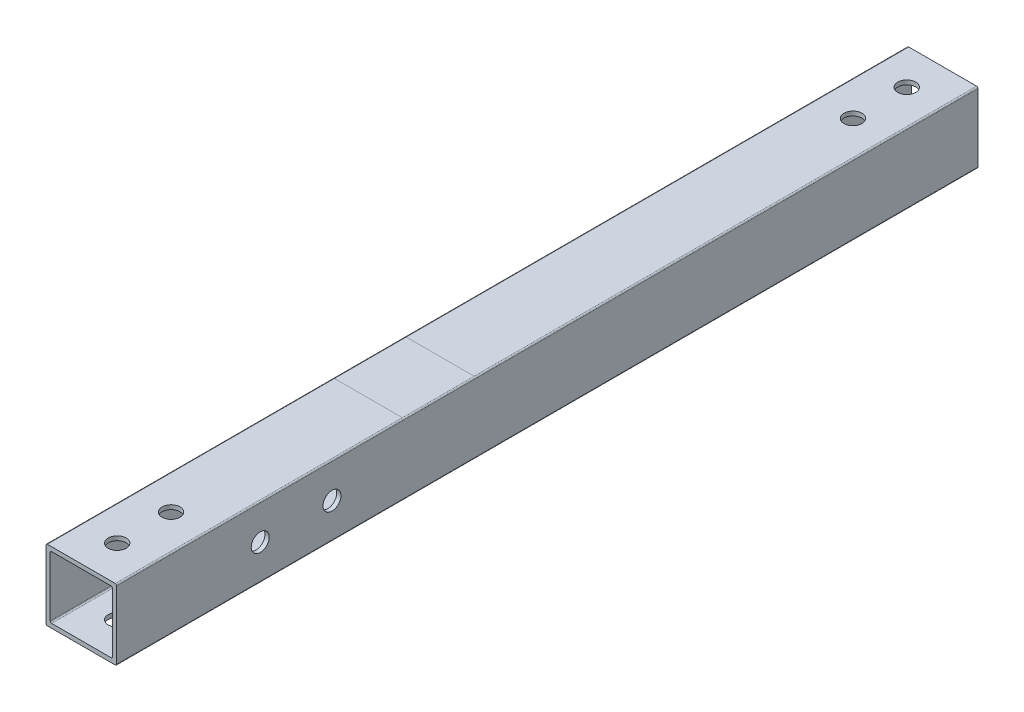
ISO-10303-21;
HEADER;
FILE_DESCRIPTION(('STEP AP214'),'2;1');
FILE_NAME('part.step','',(''),(''),'','','');
FILE_SCHEMA(('AUTOMOTIVE_DESIGN { 1 0 10303 214 1 1 1 1 }'));
ENDSEC;
DATA;
#1=APPLICATION_CONTEXT('core data for automotive mechanical design processes');
#2=APPLICATION_PROTOCOL_DEFINITION('international standard','automotive_design',2000,#1);
#3=PRODUCT_CONTEXT('',#1,'mechanical');
#4=PRODUCT('Part','Part','',(#3));
#5=PRODUCT_RELATED_PRODUCT_CATEGORY('part','',(#4));
#6=PRODUCT_DEFINITION_FORMATION('','',#4);
#7=PRODUCT_DEFINITION_CONTEXT('part definition',#1,'design');
#8=PRODUCT_DEFINITION('design','',#6,#7);
#9=PRODUCT_DEFINITION_SHAPE('','',#8);
#10=(LENGTH_UNIT() NAMED_UNIT(*) SI_UNIT(.MILLI.,.METRE.));
#11=(NAMED_UNIT(*) PLANE_ANGLE_UNIT() SI_UNIT($,.RADIAN.));
#12=(NAMED_UNIT(*) SI_UNIT($,.STERADIAN.) SOLID_ANGLE_UNIT());
#13=UNCERTAINTY_MEASURE_WITH_UNIT(LENGTH_MEASURE(1.E-05),#10,'distance_accuracy_value','');
#14=(GEOMETRIC_REPRESENTATION_CONTEXT(3) GLOBAL_UNCERTAINTY_ASSIGNED_CONTEXT((#13)) GLOBAL_UNIT_ASSIGNED_CONTEXT((#10,
#11,#12)) REPRESENTATION_CONTEXT('',''));
#15=CARTESIAN_POINT('',(0.,0.,0.));
#16=DIRECTION('',(0.,0.,1.));
#17=DIRECTION('',(1.,0.,0.));
#18=AXIS2_PLACEMENT_3D('',#15,#16,#17);
#19=CARTESIAN_POINT('',(-11.9999999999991,12.5,-1695.2));
#20=DIRECTION('',(0.,1.,0.));
#21=DIRECTION('',(-1.,0.,0.));
#22=AXIS2_PLACEMENT_3D('',#19,#20,#21);
#23=PLANE('',#22);
#24=CARTESIAN_POINT('',(0.,12.5,-1726.95));
#25=DIRECTION('',(0.,1.,0.));
#26=DIRECTION('',(1.,0.,0.));
#27=AXIS2_PLACEMENT_3D('',#24,#25,#26);
#28=CIRCLE('',#27,3.17500000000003);
#29=CARTESIAN_POINT('',(3.17500000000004,12.5,-1726.95));
#30=VERTEX_POINT('',#29);
#31=EDGE_CURVE('E366',#30,#30,#28,.T.);
#32=ORIENTED_EDGE('',*,*,#31,.F.);
#33=EDGE_LOOP('',(#32));
#34=FACE_BOUND('',#33,.T.);
#35=CARTESIAN_POINT('',(0.,12.5,-1707.9));
#36=DIRECTION('',(0.,1.,0.));
#37=DIRECTION('',(1.,0.,0.));
#38=AXIS2_PLACEMENT_3D('',#35,#36,#37);
#39=CIRCLE('',#38,3.17500000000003);
#40=CARTESIAN_POINT('',(3.17500000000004,12.5,-1707.9));
#41=VERTEX_POINT('',#40);
#42=EDGE_CURVE('E373',#41,#41,#39,.T.);
#43=ORIENTED_EDGE('',*,*,#42,.F.);
#44=EDGE_LOOP('',(#43));
#45=FACE_BOUND('',#44,.T.);
#46=DIRECTION('',(0.,0.,-1.));
#47=VECTOR('',#46,1.);
#48=CARTESIAN_POINT('',(11.9999999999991,12.5,-1695.2));
#49=LINE('',#48,#47);
#50=CARTESIAN_POINT('',(11.9999999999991,12.5,-1695.2));
#51=VERTEX_POINT('',#50);
#52=CARTESIAN_POINT('',(11.9999999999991,12.5,-1796.8));
#53=VERTEX_POINT('',#52);
#54=EDGE_CURVE('E303',#51,#53,#49,.T.);
#55=ORIENTED_EDGE('',*,*,#54,.T.);
#56=DIRECTION('',(-1.,0.,0.));
#57=VECTOR('',#56,1.);
#58=CARTESIAN_POINT('',(-11.9999999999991,12.5,-1796.8));
#59=LINE('',#58,#57);
#60=CARTESIAN_POINT('',(-11.9999999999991,12.5,-1796.8));
#61=VERTEX_POINT('',#60);
#62=EDGE_CURVE('E11',#53,#61,#59,.T.);
#63=ORIENTED_EDGE('',*,*,#62,.T.);
#64=DIRECTION('',(0.,0.,-1.));
#65=VECTOR('',#64,1.);
#66=CARTESIAN_POINT('',(-11.9999999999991,12.5,-1695.2));
#67=LINE('',#66,#65);
#68=CARTESIAN_POINT('',(-11.9999999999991,12.5,-1695.2));
#69=VERTEX_POINT('',#68);
#70=EDGE_CURVE('E308',#69,#61,#67,.T.);
#71=ORIENTED_EDGE('',*,*,#70,.F.);
#72=DIRECTION('',(1.,0.,0.));
#73=VECTOR('',#72,1.);
#74=CARTESIAN_POINT('',(-11.9999999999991,12.5,-1695.2));
#75=LINE('',#74,#73);
#76=EDGE_CURVE('E257',#69,#51,#75,.T.);
#77=ORIENTED_EDGE('',*,*,#76,.T.);
#78=EDGE_LOOP('',(#55,#63,#71,#77));
#79=FACE_BOUND('',#78,.T.);
#80=ADVANCED_FACE('F44',(#34,#45,#79),#23,.T.);
#81=CARTESIAN_POINT('',(0.,12.5,-1968.25));
#82=DIRECTION('',(0.,1.,0.));
#83=DIRECTION('',(-1.,0.,0.));
#84=AXIS2_PLACEMENT_3D('',#81,#82,#83);
#85=CIRCLE('',#84,3.17500000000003);
#86=CARTESIAN_POINT('',(-3.17500000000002,12.5,-1968.25));
#87=VERTEX_POINT('',#86);
#88=EDGE_CURVE('E361',#87,#87,#85,.T.);
#89=ORIENTED_EDGE('',*,*,#88,.F.);
#90=EDGE_LOOP('',(#89));
#91=FACE_BOUND('',#90,.T.);
#92=CARTESIAN_POINT('',(0.,12.5,-1987.3));
#93=DIRECTION('',(0.,1.,0.));
#94=DIRECTION('',(-1.,0.,0.));
#95=AXIS2_PLACEMENT_3D('',#92,#93,#94);
#96=CIRCLE('',#95,3.17500000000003);
#97=CARTESIAN_POINT('',(-3.17500000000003,12.5,-1987.3));
#98=VERTEX_POINT('',#97);
#99=EDGE_CURVE('E358',#98,#98,#96,.T.);
#100=ORIENTED_EDGE('',*,*,#99,.F.);
#101=EDGE_LOOP('',(#100));
#102=FACE_BOUND('',#101,.T.);
#103=CARTESIAN_POINT('',(-11.9999999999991,12.5,-1822.2));
#104=VERTEX_POINT('',#103);
#105=CARTESIAN_POINT('',(-11.9999999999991,12.5,-2000.));
#106=VERTEX_POINT('',#105);
#107=EDGE_CURVE('E312',#104,#106,#67,.T.);
#108=ORIENTED_EDGE('',*,*,#107,.F.);
#109=DIRECTION('',(1.,0.,0.));
#110=VECTOR('',#109,1.);
#111=CARTESIAN_POINT('',(-11.9999999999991,12.5,-1822.2));
#112=LINE('',#111,#110);
#113=CARTESIAN_POINT('',(11.9999999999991,12.5,-1822.2));
#114=VERTEX_POINT('',#113);
#115=EDGE_CURVE('E53',#104,#114,#112,.T.);
#116=ORIENTED_EDGE('',*,*,#115,.T.);
#117=CARTESIAN_POINT('',(11.9999999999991,12.5,-2000.));
#118=VERTEX_POINT('',#117);
#119=EDGE_CURVE('E307',#114,#118,#49,.T.);
#120=ORIENTED_EDGE('',*,*,#119,.T.);
#121=DIRECTION('',(1.,0.,0.));
#122=VECTOR('',#121,1.);
#123=CARTESIAN_POINT('',(-11.9999999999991,12.5,-2000.));
#124=LINE('',#123,#122);
#125=EDGE_CURVE('E281',#106,#118,#124,.T.);
#126=ORIENTED_EDGE('',*,*,#125,.F.);
#127=EDGE_LOOP('',(#108,#116,#120,#126));
#128=FACE_BOUND('',#127,.T.);
#129=ADVANCED_FACE('F413',(#91,#102,#128),#23,.T.);
#130=CARTESIAN_POINT('',(-11.9999999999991,-11.9999999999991,-1695.2));
#131=DIRECTION('',(0.,0.,-1.));
#132=DIRECTION('',(-1.,0.,0.));
#133=AXIS2_PLACEMENT_3D('',#130,#131,#132);
#134=CYLINDRICAL_SURFACE('',#133,0.500000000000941);
#135=CARTESIAN_POINT('',(-11.9999999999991,-11.9999999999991,-2000.));
#136=DIRECTION('',(0.,0.,-1.));
#137=DIRECTION('',(-1.,0.,0.));
#138=AXIS2_PLACEMENT_3D('',#135,#136,#137);
#139=CIRCLE('',#138,0.500000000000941);
#140=CARTESIAN_POINT('',(-11.9999999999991,-12.5,-2000.));
#141=VERTEX_POINT('',#140);
#142=CARTESIAN_POINT('',(-12.5,-11.9999999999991,-2000.));
#143=VERTEX_POINT('',#142);
#144=EDGE_CURVE('E235',#141,#143,#139,.T.);
#145=ORIENTED_EDGE('',*,*,#144,.F.);
#146=DIRECTION('',(0.,0.,-1.));
#147=VECTOR('',#146,1.);
#148=CARTESIAN_POINT('',(-11.9999999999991,-12.5,-1695.2));
#149=LINE('',#148,#147);
#150=CARTESIAN_POINT('',(-11.9999999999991,-12.5,-1695.2));
#151=VERTEX_POINT('',#150);
#152=EDGE_CURVE('E295',#151,#141,#149,.T.);
#153=ORIENTED_EDGE('',*,*,#152,.F.);
#154=CARTESIAN_POINT('',(-11.9999999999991,-11.9999999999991,-1695.2));
#155=DIRECTION('',(0.,0.,-1.));
#156=DIRECTION('',(-1.,0.,0.));
#157=AXIS2_PLACEMENT_3D('',#154,#155,#156);
#158=CIRCLE('',#157,0.500000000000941);
#159=CARTESIAN_POINT('',(-12.5,-11.9999999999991,-1695.2));
#160=VERTEX_POINT('',#159);
#161=EDGE_CURVE('E247',#151,#160,#158,.T.);
#162=ORIENTED_EDGE('',*,*,#161,.T.);
#163=DIRECTION('',(0.,0.,-1.));
#164=VECTOR('',#163,1.);
#165=CARTESIAN_POINT('',(-12.5,-11.9999999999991,-1695.2));
#166=LINE('',#165,#164);
#167=EDGE_CURVE('E272',#160,#143,#166,.T.);
#168=ORIENTED_EDGE('',*,*,#167,.T.);
#169=EDGE_LOOP('',(#145,#153,#162,#168));
#170=FACE_BOUND('',#169,.T.);
#171=ADVANCED_FACE('F46',(#170),#134,.T.);
#172=CARTESIAN_POINT('',(11.9999999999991,-12.5,-1695.2));
#173=DIRECTION('',(0.,-1.,0.));
#174=DIRECTION('',(1.,0.,0.));
#175=AXIS2_PLACEMENT_3D('',#172,#173,#174);
#176=PLANE('',#175);
#177=CARTESIAN_POINT('',(0.,-12.5,-1987.3));
#178=DIRECTION('',(0.,-1.,0.));
#179=DIRECTION('',(1.,0.,0.));
#180=AXIS2_PLACEMENT_3D('',#177,#178,#179);
#181=CIRCLE('',#180,3.17500000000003);
#182=CARTESIAN_POINT('',(3.17500000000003,-12.5,-1987.3));
#183=VERTEX_POINT('',#182);
#184=EDGE_CURVE('E320',#183,#183,#181,.F.);
#185=ORIENTED_EDGE('',*,*,#184,.T.);
#186=EDGE_LOOP('',(#185));
#187=FACE_BOUND('',#186,.T.);
#188=CARTESIAN_POINT('',(0.,-12.5,-1726.95));
#189=DIRECTION('',(0.,-1.,0.));
#190=DIRECTION('',(1.,0.,0.));
#191=AXIS2_PLACEMENT_3D('',#188,#189,#190);
#192=CIRCLE('',#191,3.17500000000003);
#193=CARTESIAN_POINT('',(3.17500000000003,-12.5,-1726.95));
#194=VERTEX_POINT('',#193);
#195=EDGE_CURVE('E348',#194,#194,#192,.F.);
#196=ORIENTED_EDGE('',*,*,#195,.T.);
#197=EDGE_LOOP('',(#196));
#198=FACE_BOUND('',#197,.T.);
#199=CARTESIAN_POINT('',(0.,-12.5,-1707.9));
#200=DIRECTION('',(0.,-1.,0.));
#201=DIRECTION('',(1.,0.,0.));
#202=AXIS2_PLACEMENT_3D('',#199,#200,#201);
#203=CIRCLE('',#202,3.17500000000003);
#204=CARTESIAN_POINT('',(3.17500000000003,-12.5,-1707.9));
#205=VERTEX_POINT('',#204);
#206=EDGE_CURVE('E369',#205,#205,#203,.F.);
#207=ORIENTED_EDGE('',*,*,#206,.T.);
#208=EDGE_LOOP('',(#207));
#209=FACE_BOUND('',#208,.T.);
#210=CARTESIAN_POINT('',(0.,-12.5,-1968.25));
#211=DIRECTION('',(0.,-1.,0.));
#212=DIRECTION('',(1.,0.,0.));
#213=AXIS2_PLACEMENT_3D('',#210,#211,#212);
#214=CIRCLE('',#213,3.17500000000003);
#215=CARTESIAN_POINT('',(3.17500000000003,-12.5,-1968.25));
#216=VERTEX_POINT('',#215);
#217=EDGE_CURVE('E370',#216,#216,#214,.F.);
#218=ORIENTED_EDGE('',*,*,#217,.T.);
#219=EDGE_LOOP('',(#218));
#220=FACE_BOUND('',#219,.T.);
#221=DIRECTION('',(-1.,0.,0.));
#222=VECTOR('',#221,1.);
#223=CARTESIAN_POINT('',(11.9999999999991,-12.5,-2000.));
#224=LINE('',#223,#222);
#225=CARTESIAN_POINT('',(11.9999999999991,-12.5,-2000.));
#226=VERTEX_POINT('',#225);
#227=EDGE_CURVE('E251',#226,#141,#224,.T.);
#228=ORIENTED_EDGE('',*,*,#227,.F.);
#229=DIRECTION('',(0.,0.,-1.));
#230=VECTOR('',#229,1.);
#231=CARTESIAN_POINT('',(11.9999999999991,-12.5,-1695.2));
#232=LINE('',#231,#230);
#233=CARTESIAN_POINT('',(11.9999999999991,-12.5,-1695.2));
#234=VERTEX_POINT('',#233);
#235=EDGE_CURVE('E297',#234,#226,#232,.T.);
#236=ORIENTED_EDGE('',*,*,#235,.F.);
#237=DIRECTION('',(-1.,0.,0.));
#238=VECTOR('',#237,1.);
#239=CARTESIAN_POINT('',(11.9999999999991,-12.5,-1695.2));
#240=LINE('',#239,#238);
#241=EDGE_CURVE('E269',#234,#151,#240,.T.);
#242=ORIENTED_EDGE('',*,*,#241,.T.);
#243=ORIENTED_EDGE('',*,*,#152,.T.);
#244=EDGE_LOOP('',(#228,#236,#242,#243));
#245=FACE_BOUND('',#244,.T.);
#246=ADVANCED_FACE('F447',(#187,#198,#209,#220,#245),#176,.T.);
#247=CARTESIAN_POINT('',(11.9999999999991,-11.9999999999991,-1695.2));
#248=DIRECTION('',(0.,0.,-1.));
#249=DIRECTION('',(-1.,0.,0.));
#250=AXIS2_PLACEMENT_3D('',#247,#248,#249);
#251=CYLINDRICAL_SURFACE('',#250,0.500000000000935);
#252=CARTESIAN_POINT('',(11.9999999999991,-11.9999999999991,-2000.));
#253=DIRECTION('',(0.,0.,-1.));
#254=DIRECTION('',(-1.,0.,0.));
#255=AXIS2_PLACEMENT_3D('',#252,#253,#254);
#256=CIRCLE('',#255,0.500000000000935);
#257=CARTESIAN_POINT('',(12.5,-11.9999999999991,-2000.));
#258=VERTEX_POINT('',#257);
#259=EDGE_CURVE('E290',#258,#226,#256,.T.);
#260=ORIENTED_EDGE('',*,*,#259,.F.);
#261=DIRECTION('',(0.,0.,-1.));
#262=VECTOR('',#261,1.);
#263=CARTESIAN_POINT('',(12.5,-11.9999999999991,-1695.2));
#264=LINE('',#263,#262);
#265=CARTESIAN_POINT('',(12.5,-11.9999999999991,-1695.2));
#266=VERTEX_POINT('',#265);
#267=EDGE_CURVE('E299',#266,#258,#264,.T.);
#268=ORIENTED_EDGE('',*,*,#267,.F.);
#269=CARTESIAN_POINT('',(11.9999999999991,-11.9999999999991,-1695.2));
#270=DIRECTION('',(0.,0.,-1.));
#271=DIRECTION('',(-1.,0.,0.));
#272=AXIS2_PLACEMENT_3D('',#269,#270,#271);
#273=CIRCLE('',#272,0.500000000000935);
#274=EDGE_CURVE('E266',#266,#234,#273,.T.);
#275=ORIENTED_EDGE('',*,*,#274,.T.);
#276=ORIENTED_EDGE('',*,*,#235,.T.);
#277=EDGE_LOOP('',(#260,#268,#275,#276));
#278=FACE_BOUND('',#277,.T.);
#279=ADVANCED_FACE('F440',(#278),#251,.T.);
#280=CARTESIAN_POINT('',(12.5,11.9999999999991,-1695.2));
#281=DIRECTION('',(1.,0.,0.));
#282=DIRECTION('',(0.,1.,0.));
#283=AXIS2_PLACEMENT_3D('',#280,#281,#282);
#284=PLANE('',#283);
#285=CARTESIAN_POINT('',(12.5,0.,-1771.4));
#286=DIRECTION('',(1.,0.,0.));
#287=DIRECTION('',(0.,1.,0.));
#288=AXIS2_PLACEMENT_3D('',#285,#286,#287);
#289=CIRCLE('',#288,3.17499999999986);
#290=CARTESIAN_POINT('',(12.5,3.17499999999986,-1771.4));
#291=VERTEX_POINT('',#290);
#292=EDGE_CURVE('E790',#291,#291,#289,.T.);
#293=ORIENTED_EDGE('',*,*,#292,.F.);
#294=EDGE_LOOP('',(#293));
#295=FACE_BOUND('',#294,.T.);
#296=CARTESIAN_POINT('',(12.5,0.,-1746.));
#297=DIRECTION('',(1.,0.,0.));
#298=DIRECTION('',(0.,1.,0.));
#299=AXIS2_PLACEMENT_3D('',#296,#297,#298);
#300=CIRCLE('',#299,3.17499999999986);
#301=CARTESIAN_POINT('',(12.5,3.17499999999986,-1746.));
#302=VERTEX_POINT('',#301);
#303=EDGE_CURVE('E355',#302,#302,#300,.T.);
#304=ORIENTED_EDGE('',*,*,#303,.F.);
#305=EDGE_LOOP('',(#304));
#306=FACE_BOUND('',#305,.T.);
#307=DIRECTION('',(0.,-1.,0.));
#308=VECTOR('',#307,1.);
#309=CARTESIAN_POINT('',(12.5,11.9999999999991,-2000.));
#310=LINE('',#309,#308);
#311=CARTESIAN_POINT('',(12.5,11.9999999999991,-2000.));
#312=VERTEX_POINT('',#311);
#313=EDGE_CURVE('E287',#312,#258,#310,.T.);
#314=ORIENTED_EDGE('',*,*,#313,.F.);
#315=DIRECTION('',(0.,0.,-1.));
#316=VECTOR('',#315,1.);
#317=CARTESIAN_POINT('',(12.5,11.9999999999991,-1695.2));
#318=LINE('',#317,#316);
#319=CARTESIAN_POINT('',(12.5,11.9999999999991,-1695.2));
#320=VERTEX_POINT('',#319);
#321=EDGE_CURVE('E301',#320,#312,#318,.T.);
#322=ORIENTED_EDGE('',*,*,#321,.F.);
#323=DIRECTION('',(0.,-1.,0.));
#324=VECTOR('',#323,1.);
#325=CARTESIAN_POINT('',(12.5,11.9999999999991,-1695.2));
#326=LINE('',#325,#324);
#327=EDGE_CURVE('E263',#320,#266,#326,.T.);
#328=ORIENTED_EDGE('',*,*,#327,.T.);
#329=ORIENTED_EDGE('',*,*,#267,.T.);
#330=EDGE_LOOP('',(#314,#322,#328,#329));
#331=FACE_BOUND('',#330,.T.);
#332=ADVANCED_FACE('F435',(#295,#306,#331),#284,.T.);
#333=CARTESIAN_POINT('',(11.9999999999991,11.9999999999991,-1695.2));
#334=DIRECTION('',(0.,0.,-1.));
#335=DIRECTION('',(-1.,0.,0.));
#336=AXIS2_PLACEMENT_3D('',#333,#334,#335);
#337=CYLINDRICAL_SURFACE('',#336,0.500000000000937);
#338=CARTESIAN_POINT('',(11.9999999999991,11.9999999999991,-2000.));
#339=DIRECTION('',(0.,0.,-1.));
#340=DIRECTION('',(-1.,0.,0.));
#341=AXIS2_PLACEMENT_3D('',#338,#339,#340);
#342=CIRCLE('',#341,0.500000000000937);
#343=EDGE_CURVE('E284',#118,#312,#342,.T.);
#344=ORIENTED_EDGE('',*,*,#343,.F.);
#345=ORIENTED_EDGE('',*,*,#119,.F.);
#346=EDGE_CURVE('E306',#53,#114,#49,.T.);
#347=ORIENTED_EDGE('',*,*,#346,.F.);
#348=ORIENTED_EDGE('',*,*,#54,.F.);
#349=CARTESIAN_POINT('',(11.9999999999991,11.9999999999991,-1695.2));
#350=DIRECTION('',(0.,0.,-1.));
#351=DIRECTION('',(-1.,0.,0.));
#352=AXIS2_PLACEMENT_3D('',#349,#350,#351);
#353=CIRCLE('',#352,0.500000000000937);
#354=EDGE_CURVE('E260',#51,#320,#353,.T.);
#355=ORIENTED_EDGE('',*,*,#354,.T.);
#356=ORIENTED_EDGE('',*,*,#321,.T.);
#357=EDGE_LOOP('',(#344,#345,#347,#348,#355,#356));
#358=FACE_BOUND('',#357,.T.);
#359=ADVANCED_FACE('F428',(#358),#337,.T.);
#360=ORIENTED_EDGE('',*,*,#62,.F.);
#361=ORIENTED_EDGE('',*,*,#346,.T.);
#362=ORIENTED_EDGE('',*,*,#115,.F.);
#363=EDGE_CURVE('E311',#61,#104,#67,.T.);
#364=ORIENTED_EDGE('',*,*,#363,.F.);
#365=EDGE_LOOP('',(#360,#361,#362,#364));
#366=FACE_BOUND('',#365,.T.);
#367=ADVANCED_FACE('F416',(#366),#23,.T.);
#368=CARTESIAN_POINT('',(-11.9999999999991,11.9999999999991,-1695.2));
#369=DIRECTION('',(0.,0.,-1.));
#370=DIRECTION('',(-1.,0.,0.));
#371=AXIS2_PLACEMENT_3D('',#368,#369,#370);
#372=CYLINDRICAL_SURFACE('',#371,0.500000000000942);
#373=CARTESIAN_POINT('',(-11.9999999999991,11.9999999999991,-2000.));
#374=DIRECTION('',(0.,0.,-1.));
#375=DIRECTION('',(-1.,0.,0.));
#376=AXIS2_PLACEMENT_3D('',#373,#374,#375);
#377=CIRCLE('',#376,0.500000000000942);
#378=CARTESIAN_POINT('',(-12.5,11.9999999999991,-2000.));
#379=VERTEX_POINT('',#378);
#380=EDGE_CURVE('E278',#379,#106,#377,.T.);
#381=ORIENTED_EDGE('',*,*,#380,.F.);
#382=DIRECTION('',(0.,0.,-1.));
#383=VECTOR('',#382,1.);
#384=CARTESIAN_POINT('',(-12.5,11.9999999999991,-1695.2));
#385=LINE('',#384,#383);
#386=CARTESIAN_POINT('',(-12.5,11.9999999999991,-1695.2));
#387=VERTEX_POINT('',#386);
#388=EDGE_CURVE('E313',#387,#379,#385,.T.);
#389=ORIENTED_EDGE('',*,*,#388,.F.);
#390=CARTESIAN_POINT('',(-11.9999999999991,11.9999999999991,-1695.2));
#391=DIRECTION('',(0.,0.,-1.));
#392=DIRECTION('',(-1.,0.,0.));
#393=AXIS2_PLACEMENT_3D('',#390,#391,#392);
#394=CIRCLE('',#393,0.500000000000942);
#395=EDGE_CURVE('E254',#387,#69,#394,.T.);
#396=ORIENTED_EDGE('',*,*,#395,.T.);
#397=ORIENTED_EDGE('',*,*,#70,.T.);
#398=ORIENTED_EDGE('',*,*,#363,.T.);
#399=ORIENTED_EDGE('',*,*,#107,.T.);
#400=EDGE_LOOP('',(#381,#389,#396,#397,#398,#399));
#401=FACE_BOUND('',#400,.T.);
#402=ADVANCED_FACE('F427',(#401),#372,.T.);
#403=CARTESIAN_POINT('',(-12.5,-11.9999999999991,-1695.2));
#404=DIRECTION('',(-1.,0.,0.));
#405=DIRECTION('',(0.,0.,1.));
#406=AXIS2_PLACEMENT_3D('',#403,#404,#405);
#407=PLANE('',#406);
#408=CARTESIAN_POINT('',(-12.5,0.,-1771.4));
#409=DIRECTION('',(-1.,0.,0.));
#410=DIRECTION('',(0.,0.,1.));
#411=AXIS2_PLACEMENT_3D('',#408,#409,#410);
#412=CIRCLE('',#411,3.17499999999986);
#413=CARTESIAN_POINT('',(-12.5,3.17499999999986,-1771.4));
#414=VERTEX_POINT('',#413);
#415=EDGE_CURVE('E336',#414,#414,#412,.F.);
#416=ORIENTED_EDGE('',*,*,#415,.T.);
#417=EDGE_LOOP('',(#416));
#418=FACE_BOUND('',#417,.T.);
#419=CARTESIAN_POINT('',(-12.5,0.,-1746.));
#420=DIRECTION('',(-1.,0.,0.));
#421=DIRECTION('',(0.,0.,1.));
#422=AXIS2_PLACEMENT_3D('',#419,#420,#421);
#423=CIRCLE('',#422,3.17499999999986);
#424=CARTESIAN_POINT('',(-12.5,3.17499999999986,-1746.));
#425=VERTEX_POINT('',#424);
#426=EDGE_CURVE('E794',#425,#425,#423,.F.);
#427=ORIENTED_EDGE('',*,*,#426,.T.);
#428=EDGE_LOOP('',(#427));
#429=FACE_BOUND('',#428,.T.);
#430=DIRECTION('',(0.,1.,0.));
#431=VECTOR('',#430,1.);
#432=CARTESIAN_POINT('',(-12.5,-11.9999999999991,-2000.));
#433=LINE('',#432,#431);
#434=EDGE_CURVE('E275',#143,#379,#433,.T.);
#435=ORIENTED_EDGE('',*,*,#434,.F.);
#436=ORIENTED_EDGE('',*,*,#167,.F.);
#437=DIRECTION('',(0.,1.,0.));
#438=VECTOR('',#437,1.);
#439=CARTESIAN_POINT('',(-12.5,-11.9999999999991,-1695.2));
#440=LINE('',#439,#438);
#441=EDGE_CURVE('E250',#160,#387,#440,.T.);
#442=ORIENTED_EDGE('',*,*,#441,.T.);
#443=ORIENTED_EDGE('',*,*,#388,.T.);
#444=EDGE_LOOP('',(#435,#436,#442,#443));
#445=FACE_BOUND('',#444,.T.);
#446=ADVANCED_FACE('F433',(#418,#429,#445),#407,.T.);
#447=CARTESIAN_POINT('',(-11.9999999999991,-11.9999999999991,-1695.2));
#448=DIRECTION('',(0.,0.,-1.));
#449=DIRECTION('',(-1.,0.,0.));
#450=AXIS2_PLACEMENT_3D('',#447,#448,#449);
#451=PLANE('',#450);
#452=DIRECTION('',(0.,1.,0.));
#453=VECTOR('',#452,1.);
#454=CARTESIAN_POINT('',(-11.,10.4999999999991,-1695.2));
#455=LINE('',#454,#453);
#456=CARTESIAN_POINT('',(-11.,-10.4999999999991,-1695.2));
#457=VERTEX_POINT('',#456);
#458=CARTESIAN_POINT('',(-11.,10.4999999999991,-1695.2));
#459=VERTEX_POINT('',#458);
#460=EDGE_CURVE('E180',#457,#459,#455,.T.);
#461=ORIENTED_EDGE('',*,*,#460,.T.);
#462=CARTESIAN_POINT('',(-10.4999999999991,10.4999999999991,-1695.2));
#463=DIRECTION('',(0.,0.,-1.));
#464=DIRECTION('',(1.,0.,0.));
#465=AXIS2_PLACEMENT_3D('',#462,#463,#464);
#466=CIRCLE('',#465,0.500000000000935);
#467=CARTESIAN_POINT('',(-10.4999999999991,11.,-1695.2));
#468=VERTEX_POINT('',#467);
#469=EDGE_CURVE('E172',#459,#468,#466,.T.);
#470=ORIENTED_EDGE('',*,*,#469,.T.);
#471=DIRECTION('',(1.,0.,0.));
#472=VECTOR('',#471,1.);
#473=CARTESIAN_POINT('',(10.4999999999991,11.,-1695.2));
#474=LINE('',#473,#472);
#475=CARTESIAN_POINT('',(10.4999999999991,11.,-1695.2));
#476=VERTEX_POINT('',#475);
#477=EDGE_CURVE('E184',#468,#476,#474,.T.);
#478=ORIENTED_EDGE('',*,*,#477,.T.);
#479=CARTESIAN_POINT('',(10.4999999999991,10.4999999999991,-1695.2));
#480=DIRECTION('',(0.,0.,-1.));
#481=DIRECTION('',(1.,0.,0.));
#482=AXIS2_PLACEMENT_3D('',#479,#480,#481);
#483=CIRCLE('',#482,0.500000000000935);
#484=CARTESIAN_POINT('',(11.,10.4999999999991,-1695.2));
#485=VERTEX_POINT('',#484);
#486=EDGE_CURVE('E188',#476,#485,#483,.T.);
#487=ORIENTED_EDGE('',*,*,#486,.T.);
#488=DIRECTION('',(0.,-1.,0.));
#489=VECTOR('',#488,1.);
#490=CARTESIAN_POINT('',(11.,-10.4999999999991,-1695.2));
#491=LINE('',#490,#489);
#492=CARTESIAN_POINT('',(11.,-10.4999999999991,-1695.2));
#493=VERTEX_POINT('',#492);
#494=EDGE_CURVE('E204',#485,#493,#491,.T.);
#495=ORIENTED_EDGE('',*,*,#494,.T.);
#496=CARTESIAN_POINT('',(10.4999999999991,-10.4999999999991,-1695.2));
#497=DIRECTION('',(0.,0.,-1.));
#498=DIRECTION('',(1.,0.,0.));
#499=AXIS2_PLACEMENT_3D('',#496,#497,#498);
#500=CIRCLE('',#499,0.500000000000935);
#501=CARTESIAN_POINT('',(10.4999999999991,-11.,-1695.2));
#502=VERTEX_POINT('',#501);
#503=EDGE_CURVE('E207',#493,#502,#500,.T.);
#504=ORIENTED_EDGE('',*,*,#503,.T.);
#505=DIRECTION('',(-1.,0.,0.));
#506=VECTOR('',#505,1.);
#507=CARTESIAN_POINT('',(-10.4999999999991,-11.,-1695.2));
#508=LINE('',#507,#506);
#509=CARTESIAN_POINT('',(-10.4999999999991,-11.,-1695.2));
#510=VERTEX_POINT('',#509);
#511=EDGE_CURVE('E210',#502,#510,#508,.T.);
#512=ORIENTED_EDGE('',*,*,#511,.T.);
#513=CARTESIAN_POINT('',(-10.4999999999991,-10.4999999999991,-1695.2));
#514=DIRECTION('',(0.,0.,-1.));
#515=DIRECTION('',(1.,0.,0.));
#516=AXIS2_PLACEMENT_3D('',#513,#514,#515);
#517=CIRCLE('',#516,0.500000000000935);
#518=EDGE_CURVE('E213',#510,#457,#517,.T.);
#519=ORIENTED_EDGE('',*,*,#518,.T.);
#520=EDGE_LOOP('',(#461,#470,#478,#487,#495,#504,#512,#519));
#521=FACE_BOUND('',#520,.T.);
#522=ORIENTED_EDGE('',*,*,#161,.F.);
#523=ORIENTED_EDGE('',*,*,#241,.F.);
#524=ORIENTED_EDGE('',*,*,#274,.F.);
#525=ORIENTED_EDGE('',*,*,#327,.F.);
#526=ORIENTED_EDGE('',*,*,#354,.F.);
#527=ORIENTED_EDGE('',*,*,#76,.F.);
#528=ORIENTED_EDGE('',*,*,#395,.F.);
#529=ORIENTED_EDGE('',*,*,#441,.F.);
#530=EDGE_LOOP('',(#522,#523,#524,#525,#526,#527,#528,#529));
#531=FACE_BOUND('',#530,.T.);
#532=ADVANCED_FACE('F190',(#521,#531),#451,.F.);
#533=CARTESIAN_POINT('',(-11.9999999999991,-11.9999999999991,-2000.));
#534=DIRECTION('',(0.,0.,-1.));
#535=DIRECTION('',(-1.,0.,0.));
#536=AXIS2_PLACEMENT_3D('',#533,#534,#535);
#537=PLANE('',#536);
#538=CARTESIAN_POINT('',(-10.4999999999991,10.4999999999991,-2000.));
#539=DIRECTION('',(0.,0.,-1.));
#540=DIRECTION('',(1.,0.,0.));
#541=AXIS2_PLACEMENT_3D('',#538,#539,#540);
#542=CIRCLE('',#541,0.500000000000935);
#543=CARTESIAN_POINT('',(-11.,10.4999999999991,-2000.));
#544=VERTEX_POINT('',#543);
#545=CARTESIAN_POINT('',(-10.4999999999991,11.,-2000.));
#546=VERTEX_POINT('',#545);
#547=EDGE_CURVE('E175',#544,#546,#542,.T.);
#548=ORIENTED_EDGE('',*,*,#547,.F.);
#549=DIRECTION('',(0.,1.,0.));
#550=VECTOR('',#549,1.);
#551=CARTESIAN_POINT('',(-11.,10.4999999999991,-2000.));
#552=LINE('',#551,#550);
#553=CARTESIAN_POINT('',(-11.,-10.4999999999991,-2000.));
#554=VERTEX_POINT('',#553);
#555=EDGE_CURVE('E194',#554,#544,#552,.T.);
#556=ORIENTED_EDGE('',*,*,#555,.F.);
#557=CARTESIAN_POINT('',(-10.4999999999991,-10.4999999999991,-2000.));
#558=DIRECTION('',(0.,0.,-1.));
#559=DIRECTION('',(1.,0.,0.));
#560=AXIS2_PLACEMENT_3D('',#557,#558,#559);
#561=CIRCLE('',#560,0.500000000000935);
#562=CARTESIAN_POINT('',(-10.4999999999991,-11.,-2000.));
#563=VERTEX_POINT('',#562);
#564=EDGE_CURVE('E197',#563,#554,#561,.T.);
#565=ORIENTED_EDGE('',*,*,#564,.F.);
#566=DIRECTION('',(-1.,0.,0.));
#567=VECTOR('',#566,1.);
#568=CARTESIAN_POINT('',(-10.4999999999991,-11.,-2000.));
#569=LINE('',#568,#567);
#570=CARTESIAN_POINT('',(10.4999999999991,-11.,-2000.));
#571=VERTEX_POINT('',#570);
#572=EDGE_CURVE('E228',#571,#563,#569,.T.);
#573=ORIENTED_EDGE('',*,*,#572,.F.);
#574=CARTESIAN_POINT('',(10.4999999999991,-10.4999999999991,-2000.));
#575=DIRECTION('',(0.,0.,-1.));
#576=DIRECTION('',(1.,0.,0.));
#577=AXIS2_PLACEMENT_3D('',#574,#575,#576);
#578=CIRCLE('',#577,0.500000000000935);
#579=CARTESIAN_POINT('',(11.,-10.4999999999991,-2000.));
#580=VERTEX_POINT('',#579);
#581=EDGE_CURVE('E225',#580,#571,#578,.T.);
#582=ORIENTED_EDGE('',*,*,#581,.F.);
#583=DIRECTION('',(0.,-1.,0.));
#584=VECTOR('',#583,1.);
#585=CARTESIAN_POINT('',(11.,-10.4999999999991,-2000.));
#586=LINE('',#585,#584);
#587=CARTESIAN_POINT('',(11.,10.4999999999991,-2000.));
#588=VERTEX_POINT('',#587);
#589=EDGE_CURVE('E222',#588,#580,#586,.T.);
#590=ORIENTED_EDGE('',*,*,#589,.F.);
#591=CARTESIAN_POINT('',(10.4999999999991,10.4999999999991,-2000.));
#592=DIRECTION('',(0.,0.,-1.));
#593=DIRECTION('',(1.,0.,0.));
#594=AXIS2_PLACEMENT_3D('',#591,#592,#593);
#595=CIRCLE('',#594,0.500000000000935);
#596=CARTESIAN_POINT('',(10.4999999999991,11.,-2000.));
#597=VERTEX_POINT('',#596);
#598=EDGE_CURVE('E219',#597,#588,#595,.T.);
#599=ORIENTED_EDGE('',*,*,#598,.F.);
#600=DIRECTION('',(1.,0.,0.));
#601=VECTOR('',#600,1.);
#602=CARTESIAN_POINT('',(10.4999999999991,11.,-2000.));
#603=LINE('',#602,#601);
#604=EDGE_CURVE('E217',#546,#597,#603,.T.);
#605=ORIENTED_EDGE('',*,*,#604,.F.);
#606=EDGE_LOOP('',(#548,#556,#565,#573,#582,#590,#599,#605));
#607=FACE_BOUND('',#606,.T.);
#608=ORIENTED_EDGE('',*,*,#144,.T.);
#609=ORIENTED_EDGE('',*,*,#434,.T.);
#610=ORIENTED_EDGE('',*,*,#380,.T.);
#611=ORIENTED_EDGE('',*,*,#125,.T.);
#612=ORIENTED_EDGE('',*,*,#343,.T.);
#613=ORIENTED_EDGE('',*,*,#313,.T.);
#614=ORIENTED_EDGE('',*,*,#259,.T.);
#615=ORIENTED_EDGE('',*,*,#227,.T.);
#616=EDGE_LOOP('',(#608,#609,#610,#611,#612,#613,#614,#615));
#617=FACE_BOUND('',#616,.T.);
#618=ADVANCED_FACE('F452',(#607,#617),#537,.T.);
#619=CARTESIAN_POINT('',(-10.4999999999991,10.4999999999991,-1695.2));
#620=DIRECTION('',(0.,0.,-1.));
#621=DIRECTION('',(-1.,0.,0.));
#622=AXIS2_PLACEMENT_3D('',#619,#620,#621);
#623=CYLINDRICAL_SURFACE('',#622,0.500000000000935);
#624=ORIENTED_EDGE('',*,*,#547,.T.);
#625=DIRECTION('',(0.,0.,-1.));
#626=VECTOR('',#625,1.);
#627=CARTESIAN_POINT('',(-10.4999999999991,11.,-1695.2));
#628=LINE('',#627,#626);
#629=EDGE_CURVE('E168',#468,#546,#628,.T.);
#630=ORIENTED_EDGE('',*,*,#629,.F.);
#631=ORIENTED_EDGE('',*,*,#469,.F.);
#632=DIRECTION('',(0.,0.,-1.));
#633=VECTOR('',#632,1.);
#634=CARTESIAN_POINT('',(-11.,10.4999999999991,-1695.2));
#635=LINE('',#634,#633);
#636=EDGE_CURVE('E233',#459,#544,#635,.T.);
#637=ORIENTED_EDGE('',*,*,#636,.T.);
#638=EDGE_LOOP('',(#624,#630,#631,#637));
#639=FACE_BOUND('',#638,.T.);
#640=ADVANCED_FACE('F170',(#639),#623,.F.);
#641=CARTESIAN_POINT('',(-11.,10.4999999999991,-1695.2));
#642=DIRECTION('',(-1.,0.,0.));
#643=DIRECTION('',(0.,-1.,0.));
#644=AXIS2_PLACEMENT_3D('',#641,#642,#643);
#645=PLANE('',#644);
#646=CARTESIAN_POINT('',(-11.,0.,-1771.4));
#647=DIRECTION('',(-1.,0.,0.));
#648=DIRECTION('',(0.,-1.,0.));
#649=AXIS2_PLACEMENT_3D('',#646,#647,#648);
#650=CIRCLE('',#649,3.17499999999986);
#651=CARTESIAN_POINT('',(-11.,3.17499999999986,-1771.4));
#652=VERTEX_POINT('',#651);
#653=EDGE_CURVE('E339',#652,#652,#650,.T.);
#654=ORIENTED_EDGE('',*,*,#653,.T.);
#655=EDGE_LOOP('',(#654));
#656=FACE_BOUND('',#655,.T.);
#657=CARTESIAN_POINT('',(-11.,0.,-1746.));
#658=DIRECTION('',(-1.,0.,0.));
#659=DIRECTION('',(0.,-1.,0.));
#660=AXIS2_PLACEMENT_3D('',#657,#658,#659);
#661=CIRCLE('',#660,3.17499999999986);
#662=CARTESIAN_POINT('',(-11.,3.17499999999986,-1746.));
#663=VERTEX_POINT('',#662);
#664=EDGE_CURVE('E335',#663,#663,#661,.T.);
#665=ORIENTED_EDGE('',*,*,#664,.T.);
#666=EDGE_LOOP('',(#665));
#667=FACE_BOUND('',#666,.T.);
#668=ORIENTED_EDGE('',*,*,#555,.T.);
#669=ORIENTED_EDGE('',*,*,#636,.F.);
#670=ORIENTED_EDGE('',*,*,#460,.F.);
#671=DIRECTION('',(0.,0.,-1.));
#672=VECTOR('',#671,1.);
#673=CARTESIAN_POINT('',(-11.,-10.4999999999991,-1695.2));
#674=LINE('',#673,#672);
#675=EDGE_CURVE('E236',#457,#554,#674,.T.);
#676=ORIENTED_EDGE('',*,*,#675,.T.);
#677=EDGE_LOOP('',(#668,#669,#670,#676));
#678=FACE_BOUND('',#677,.T.);
#679=ADVANCED_FACE('F460',(#656,#667,#678),#645,.F.);
#680=CARTESIAN_POINT('',(-10.4999999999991,-10.4999999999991,-1695.2));
#681=DIRECTION('',(0.,0.,-1.));
#682=DIRECTION('',(-1.,0.,0.));
#683=AXIS2_PLACEMENT_3D('',#680,#681,#682);
#684=CYLINDRICAL_SURFACE('',#683,0.500000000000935);
#685=ORIENTED_EDGE('',*,*,#564,.T.);
#686=ORIENTED_EDGE('',*,*,#675,.F.);
#687=ORIENTED_EDGE('',*,*,#518,.F.);
#688=DIRECTION('',(0.,0.,-1.));
#689=VECTOR('',#688,1.);
#690=CARTESIAN_POINT('',(-10.4999999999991,-11.,-1695.2));
#691=LINE('',#690,#689);
#692=EDGE_CURVE('E238',#510,#563,#691,.T.);
#693=ORIENTED_EDGE('',*,*,#692,.T.);
#694=EDGE_LOOP('',(#685,#686,#687,#693));
#695=FACE_BOUND('',#694,.T.);
#696=ADVANCED_FACE('F478',(#695),#684,.F.);
#697=CARTESIAN_POINT('',(-10.4999999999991,-11.,-1695.2));
#698=DIRECTION('',(0.,-1.,0.));
#699=DIRECTION('',(0.,0.,-1.));
#700=AXIS2_PLACEMENT_3D('',#697,#698,#699);
#701=PLANE('',#700);
#702=CARTESIAN_POINT('',(0.,-11.,-1987.3));
#703=DIRECTION('',(0.,-1.,0.));
#704=DIRECTION('',(0.,0.,-1.));
#705=AXIS2_PLACEMENT_3D('',#702,#703,#704);
#706=CIRCLE('',#705,3.17500000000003);
#707=CARTESIAN_POINT('',(0.,-11.,-1990.475));
#708=VERTEX_POINT('',#707);
#709=EDGE_CURVE('E200',#708,#708,#706,.T.);
#710=ORIENTED_EDGE('',*,*,#709,.T.);
#711=EDGE_LOOP('',(#710));
#712=FACE_BOUND('',#711,.T.);
#713=CARTESIAN_POINT('',(0.,-11.,-1726.95));
#714=DIRECTION('',(0.,-1.,0.));
#715=DIRECTION('',(0.,0.,-1.));
#716=AXIS2_PLACEMENT_3D('',#713,#714,#715);
#717=CIRCLE('',#716,3.17500000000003);
#718=CARTESIAN_POINT('',(0.,-11.,-1730.125));
#719=VERTEX_POINT('',#718);
#720=EDGE_CURVE('E328',#719,#719,#717,.T.);
#721=ORIENTED_EDGE('',*,*,#720,.T.);
#722=EDGE_LOOP('',(#721));
#723=FACE_BOUND('',#722,.T.);
#724=CARTESIAN_POINT('',(0.,-11.,-1707.9));
#725=DIRECTION('',(0.,-1.,0.));
#726=DIRECTION('',(0.,0.,-1.));
#727=AXIS2_PLACEMENT_3D('',#724,#725,#726);
#728=CIRCLE('',#727,3.17500000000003);
#729=CARTESIAN_POINT('',(0.,-11.,-1711.075));
#730=VERTEX_POINT('',#729);
#731=EDGE_CURVE('E324',#730,#730,#728,.T.);
#732=ORIENTED_EDGE('',*,*,#731,.T.);
#733=EDGE_LOOP('',(#732));
#734=FACE_BOUND('',#733,.T.);
#735=CARTESIAN_POINT('',(0.,-11.,-1968.25));
#736=DIRECTION('',(0.,-1.,0.));
#737=DIRECTION('',(0.,0.,-1.));
#738=AXIS2_PLACEMENT_3D('',#735,#736,#737);
#739=CIRCLE('',#738,3.17500000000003);
#740=CARTESIAN_POINT('',(0.,-11.,-1971.425));
#741=VERTEX_POINT('',#740);
#742=EDGE_CURVE('E319',#741,#741,#739,.T.);
#743=ORIENTED_EDGE('',*,*,#742,.T.);
#744=EDGE_LOOP('',(#743));
#745=FACE_BOUND('',#744,.T.);
#746=ORIENTED_EDGE('',*,*,#572,.T.);
#747=ORIENTED_EDGE('',*,*,#692,.F.);
#748=ORIENTED_EDGE('',*,*,#511,.F.);
#749=DIRECTION('',(0.,0.,-1.));
#750=VECTOR('',#749,1.);
#751=CARTESIAN_POINT('',(10.4999999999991,-11.,-1695.2));
#752=LINE('',#751,#750);
#753=EDGE_CURVE('E240',#502,#571,#752,.T.);
#754=ORIENTED_EDGE('',*,*,#753,.T.);
#755=EDGE_LOOP('',(#746,#747,#748,#754));
#756=FACE_BOUND('',#755,.T.);
#757=ADVANCED_FACE('F386',(#712,#723,#734,#745,#756),#701,.F.);
#758=CARTESIAN_POINT('',(10.4999999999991,-10.4999999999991,-1695.2));
#759=DIRECTION('',(0.,0.,-1.));
#760=DIRECTION('',(-1.,0.,0.));
#761=AXIS2_PLACEMENT_3D('',#758,#759,#760);
#762=CYLINDRICAL_SURFACE('',#761,0.500000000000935);
#763=ORIENTED_EDGE('',*,*,#581,.T.);
#764=ORIENTED_EDGE('',*,*,#753,.F.);
#765=ORIENTED_EDGE('',*,*,#503,.F.);
#766=DIRECTION('',(0.,0.,-1.));
#767=VECTOR('',#766,1.);
#768=CARTESIAN_POINT('',(11.,-10.4999999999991,-1695.2));
#769=LINE('',#768,#767);
#770=EDGE_CURVE('E242',#493,#580,#769,.T.);
#771=ORIENTED_EDGE('',*,*,#770,.T.);
#772=EDGE_LOOP('',(#763,#764,#765,#771));
#773=FACE_BOUND('',#772,.T.);
#774=ADVANCED_FACE('F472',(#773),#762,.F.);
#775=CARTESIAN_POINT('',(11.,-10.4999999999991,-1695.2));
#776=DIRECTION('',(1.,0.,0.));
#777=DIRECTION('',(0.,0.,-1.));
#778=AXIS2_PLACEMENT_3D('',#775,#776,#777);
#779=PLANE('',#778);
#780=CARTESIAN_POINT('',(11.,0.,-1771.4));
#781=DIRECTION('',(1.,0.,0.));
#782=DIRECTION('',(0.,0.,-1.));
#783=AXIS2_PLACEMENT_3D('',#780,#781,#782);
#784=CIRCLE('',#783,3.17499999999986);
#785=CARTESIAN_POINT('',(11.,0.,-1774.575));
#786=VERTEX_POINT('',#785);
#787=EDGE_CURVE('E337',#786,#786,#784,.T.);
#788=ORIENTED_EDGE('',*,*,#787,.T.);
#789=EDGE_LOOP('',(#788));
#790=FACE_BOUND('',#789,.T.);
#791=CARTESIAN_POINT('',(11.,0.,-1746.));
#792=DIRECTION('',(1.,0.,0.));
#793=DIRECTION('',(0.,0.,-1.));
#794=AXIS2_PLACEMENT_3D('',#791,#792,#793);
#795=CIRCLE('',#794,3.17499999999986);
#796=CARTESIAN_POINT('',(11.,0.,-1749.175));
#797=VERTEX_POINT('',#796);
#798=EDGE_CURVE('E332',#797,#797,#795,.T.);
#799=ORIENTED_EDGE('',*,*,#798,.T.);
#800=EDGE_LOOP('',(#799));
#801=FACE_BOUND('',#800,.T.);
#802=ORIENTED_EDGE('',*,*,#589,.T.);
#803=ORIENTED_EDGE('',*,*,#770,.F.);
#804=ORIENTED_EDGE('',*,*,#494,.F.);
#805=DIRECTION('',(0.,0.,-1.));
#806=VECTOR('',#805,1.);
#807=CARTESIAN_POINT('',(11.,10.4999999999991,-1695.2));
#808=LINE('',#807,#806);
#809=EDGE_CURVE('E244',#485,#588,#808,.T.);
#810=ORIENTED_EDGE('',*,*,#809,.T.);
#811=EDGE_LOOP('',(#802,#803,#804,#810));
#812=FACE_BOUND('',#811,.T.);
#813=ADVANCED_FACE('F468',(#790,#801,#812),#779,.F.);
#814=CARTESIAN_POINT('',(10.4999999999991,10.4999999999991,-1695.2));
#815=DIRECTION('',(0.,0.,-1.));
#816=DIRECTION('',(-1.,0.,0.));
#817=AXIS2_PLACEMENT_3D('',#814,#815,#816);
#818=CYLINDRICAL_SURFACE('',#817,0.500000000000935);
#819=ORIENTED_EDGE('',*,*,#598,.T.);
#820=ORIENTED_EDGE('',*,*,#809,.F.);
#821=ORIENTED_EDGE('',*,*,#486,.F.);
#822=DIRECTION('',(0.,0.,-1.));
#823=VECTOR('',#822,1.);
#824=CARTESIAN_POINT('',(10.4999999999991,11.,-1695.2));
#825=LINE('',#824,#823);
#826=EDGE_CURVE('E179',#476,#597,#825,.T.);
#827=ORIENTED_EDGE('',*,*,#826,.T.);
#828=EDGE_LOOP('',(#819,#820,#821,#827));
#829=FACE_BOUND('',#828,.T.);
#830=ADVANCED_FACE('F464',(#829),#818,.F.);
#831=CARTESIAN_POINT('',(10.4999999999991,11.,-1695.2));
#832=DIRECTION('',(0.,1.,0.));
#833=DIRECTION('',(-1.,0.,0.));
#834=AXIS2_PLACEMENT_3D('',#831,#832,#833);
#835=PLANE('',#834);
#836=CARTESIAN_POINT('',(0.,11.,-1987.3));
#837=DIRECTION('',(0.,1.,0.));
#838=DIRECTION('',(-1.,0.,0.));
#839=AXIS2_PLACEMENT_3D('',#836,#837,#838);
#840=CIRCLE('',#839,3.17500000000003);
#841=CARTESIAN_POINT('',(-3.17500000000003,11.,-1987.3));
#842=VERTEX_POINT('',#841);
#843=EDGE_CURVE('E329',#842,#842,#840,.T.);
#844=ORIENTED_EDGE('',*,*,#843,.T.);
#845=EDGE_LOOP('',(#844));
#846=FACE_BOUND('',#845,.T.);
#847=CARTESIAN_POINT('',(0.,11.,-1726.95));
#848=DIRECTION('',(0.,1.,0.));
#849=DIRECTION('',(-1.,0.,0.));
#850=AXIS2_PLACEMENT_3D('',#847,#848,#849);
#851=CIRCLE('',#850,3.17500000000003);
#852=CARTESIAN_POINT('',(-3.17500000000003,11.,-1726.95));
#853=VERTEX_POINT('',#852);
#854=EDGE_CURVE('E325',#853,#853,#851,.T.);
#855=ORIENTED_EDGE('',*,*,#854,.T.);
#856=EDGE_LOOP('',(#855));
#857=FACE_BOUND('',#856,.T.);
#858=CARTESIAN_POINT('',(0.,11.,-1707.9));
#859=DIRECTION('',(0.,1.,0.));
#860=DIRECTION('',(-1.,0.,0.));
#861=AXIS2_PLACEMENT_3D('',#858,#859,#860);
#862=CIRCLE('',#861,3.17500000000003);
#863=CARTESIAN_POINT('',(-3.17500000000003,11.,-1707.9));
#864=VERTEX_POINT('',#863);
#865=EDGE_CURVE('E321',#864,#864,#862,.T.);
#866=ORIENTED_EDGE('',*,*,#865,.T.);
#867=EDGE_LOOP('',(#866));
#868=FACE_BOUND('',#867,.T.);
#869=CARTESIAN_POINT('',(0.,11.,-1968.25));
#870=DIRECTION('',(0.,1.,0.));
#871=DIRECTION('',(-1.,0.,0.));
#872=AXIS2_PLACEMENT_3D('',#869,#870,#871);
#873=CIRCLE('',#872,3.17500000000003);
#874=CARTESIAN_POINT('',(-3.17500000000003,11.,-1968.25));
#875=VERTEX_POINT('',#874);
#876=EDGE_CURVE('E316',#875,#875,#873,.T.);
#877=ORIENTED_EDGE('',*,*,#876,.T.);
#878=EDGE_LOOP('',(#877));
#879=FACE_BOUND('',#878,.T.);
#880=ORIENTED_EDGE('',*,*,#604,.T.);
#881=ORIENTED_EDGE('',*,*,#826,.F.);
#882=ORIENTED_EDGE('',*,*,#477,.F.);
#883=ORIENTED_EDGE('',*,*,#629,.T.);
#884=EDGE_LOOP('',(#880,#881,#882,#883));
#885=FACE_BOUND('',#884,.T.);
#886=ADVANCED_FACE('F185',(#846,#857,#868,#879,#885),#835,.F.);
#887=CARTESIAN_POINT('',(0.,-21.4802561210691,-1968.25));
#888=DIRECTION('',(0.,1.,0.));
#889=DIRECTION('',(-1.,0.,0.));
#890=AXIS2_PLACEMENT_3D('',#887,#888,#889);
#891=CYLINDRICAL_SURFACE('',#890,3.17500000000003);
#892=ORIENTED_EDGE('',*,*,#88,.T.);
#893=EDGE_LOOP('',(#892));
#894=FACE_BOUND('',#893,.T.);
#895=ORIENTED_EDGE('',*,*,#876,.F.);
#896=EDGE_LOOP('',(#895));
#897=FACE_BOUND('',#896,.T.);
#898=ADVANCED_FACE('F463',(#894,#897),#891,.F.);
#899=CARTESIAN_POINT('',(0.,-21.4802561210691,-1707.9));
#900=DIRECTION('',(0.,1.,0.));
#901=DIRECTION('',(-1.,0.,0.));
#902=AXIS2_PLACEMENT_3D('',#899,#900,#901);
#903=CYLINDRICAL_SURFACE('',#902,3.17500000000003);
#904=ORIENTED_EDGE('',*,*,#42,.T.);
#905=EDGE_LOOP('',(#904));
#906=FACE_BOUND('',#905,.T.);
#907=ORIENTED_EDGE('',*,*,#865,.F.);
#908=EDGE_LOOP('',(#907));
#909=FACE_BOUND('',#908,.T.);
#910=ADVANCED_FACE('F407',(#906,#909),#903,.F.);
#911=CARTESIAN_POINT('',(0.,-21.4802561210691,-1726.95));
#912=DIRECTION('',(0.,1.,0.));
#913=DIRECTION('',(-1.,0.,0.));
#914=AXIS2_PLACEMENT_3D('',#911,#912,#913);
#915=CYLINDRICAL_SURFACE('',#914,3.17500000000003);
#916=ORIENTED_EDGE('',*,*,#31,.T.);
#917=EDGE_LOOP('',(#916));
#918=FACE_BOUND('',#917,.T.);
#919=ORIENTED_EDGE('',*,*,#854,.F.);
#920=EDGE_LOOP('',(#919));
#921=FACE_BOUND('',#920,.T.);
#922=ADVANCED_FACE('F395',(#918,#921),#915,.F.);
#923=CARTESIAN_POINT('',(0.,-21.4802561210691,-1987.3));
#924=DIRECTION('',(0.,1.,0.));
#925=DIRECTION('',(-1.,0.,0.));
#926=AXIS2_PLACEMENT_3D('',#923,#924,#925);
#927=CYLINDRICAL_SURFACE('',#926,3.17500000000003);
#928=ORIENTED_EDGE('',*,*,#99,.T.);
#929=EDGE_LOOP('',(#928));
#930=FACE_BOUND('',#929,.T.);
#931=ORIENTED_EDGE('',*,*,#843,.F.);
#932=EDGE_LOOP('',(#931));
#933=FACE_BOUND('',#932,.T.);
#934=ADVANCED_FACE('F403',(#930,#933),#927,.F.);
#935=ORIENTED_EDGE('',*,*,#217,.F.);
#936=EDGE_LOOP('',(#935));
#937=FACE_BOUND('',#936,.T.);
#938=ORIENTED_EDGE('',*,*,#742,.F.);
#939=EDGE_LOOP('',(#938));
#940=FACE_BOUND('',#939,.T.);
#941=ADVANCED_FACE('F404',(#937,#940),#891,.F.);
#942=ORIENTED_EDGE('',*,*,#206,.F.);
#943=EDGE_LOOP('',(#942));
#944=FACE_BOUND('',#943,.T.);
#945=ORIENTED_EDGE('',*,*,#731,.F.);
#946=EDGE_LOOP('',(#945));
#947=FACE_BOUND('',#946,.T.);
#948=ADVANCED_FACE('F392',(#944,#947),#903,.F.);
#949=ORIENTED_EDGE('',*,*,#195,.F.);
#950=EDGE_LOOP('',(#949));
#951=FACE_BOUND('',#950,.T.);
#952=ORIENTED_EDGE('',*,*,#720,.F.);
#953=EDGE_LOOP('',(#952));
#954=FACE_BOUND('',#953,.T.);
#955=ADVANCED_FACE('F389',(#951,#954),#915,.F.);
#956=ORIENTED_EDGE('',*,*,#184,.F.);
#957=EDGE_LOOP('',(#956));
#958=FACE_BOUND('',#957,.T.);
#959=ORIENTED_EDGE('',*,*,#709,.F.);
#960=EDGE_LOOP('',(#959));
#961=FACE_BOUND('',#960,.T.);
#962=ADVANCED_FACE('F391',(#958,#961),#927,.F.);
#963=CARTESIAN_POINT('',(-21.4802561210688,0.,-1746.));
#964=DIRECTION('',(1.,0.,0.));
#965=DIRECTION('',(0.,1.,0.));
#966=AXIS2_PLACEMENT_3D('',#963,#964,#965);
#967=CYLINDRICAL_SURFACE('',#966,3.17499999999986);
#968=ORIENTED_EDGE('',*,*,#303,.T.);
#969=EDGE_LOOP('',(#968));
#970=FACE_BOUND('',#969,.T.);
#971=ORIENTED_EDGE('',*,*,#798,.F.);
#972=EDGE_LOOP('',(#971));
#973=FACE_BOUND('',#972,.T.);
#974=ADVANCED_FACE('F400',(#970,#973),#967,.F.);
#975=CARTESIAN_POINT('',(-21.4802561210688,0.,-1771.4));
#976=DIRECTION('',(1.,0.,0.));
#977=DIRECTION('',(0.,1.,0.));
#978=AXIS2_PLACEMENT_3D('',#975,#976,#977);
#979=CYLINDRICAL_SURFACE('',#978,3.17499999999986);
#980=ORIENTED_EDGE('',*,*,#292,.T.);
#981=EDGE_LOOP('',(#980));
#982=FACE_BOUND('',#981,.T.);
#983=ORIENTED_EDGE('',*,*,#787,.F.);
#984=EDGE_LOOP('',(#983));
#985=FACE_BOUND('',#984,.T.);
#986=ADVANCED_FACE('F689',(#982,#985),#979,.F.);
#987=CARTESIAN_POINT('',(-12.5,3.17499999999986,-1746.));
#988=CARTESIAN_POINT('',(-12.484375,3.17499999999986,-1746.));
#989=CARTESIAN_POINT('',(-12.46875,3.17499999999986,-1746.));
#990=CARTESIAN_POINT('',(-12.4375,3.17499999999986,-1746.));
#991=CARTESIAN_POINT('',(-12.421875,3.17499999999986,-1746.));
#992=CARTESIAN_POINT('',(-12.390625,3.17499999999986,-1746.));
#993=CARTESIAN_POINT('',(-12.375,3.17499999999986,-1746.));
#994=CARTESIAN_POINT('',(-12.34375,3.17499999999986,-1746.));
#995=CARTESIAN_POINT('',(-12.328125,3.17499999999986,-1746.));
#996=CARTESIAN_POINT('',(-12.296875,3.17499999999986,-1746.));
#997=CARTESIAN_POINT('',(-12.28125,3.17499999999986,-1746.));
#998=CARTESIAN_POINT('',(-12.25,3.17499999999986,-1746.));
#999=CARTESIAN_POINT('',(-12.234375,3.17499999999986,-1746.));
#1000=CARTESIAN_POINT('',(-12.203125,3.17499999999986,-1746.));
#1001=CARTESIAN_POINT('',(-12.1875,3.17499999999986,-1746.));
#1002=CARTESIAN_POINT('',(-12.15625,3.17499999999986,-1746.));
#1003=CARTESIAN_POINT('',(-12.140625,3.17499999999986,-1746.));
#1004=CARTESIAN_POINT('',(-12.109375,3.17499999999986,-1746.));
#1005=CARTESIAN_POINT('',(-12.09375,3.17499999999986,-1746.));
#1006=CARTESIAN_POINT('',(-12.0625,3.17499999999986,-1746.));
#1007=CARTESIAN_POINT('',(-12.046875,3.17499999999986,-1746.));
#1008=CARTESIAN_POINT('',(-12.015625,3.17499999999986,-1746.));
#1009=CARTESIAN_POINT('',(-12.,3.17499999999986,-1746.));
#1010=CARTESIAN_POINT('',(-11.96875,3.17499999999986,-1746.));
#1011=CARTESIAN_POINT('',(-11.953125,3.17499999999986,-1746.));
#1012=CARTESIAN_POINT('',(-11.921875,3.17499999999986,-1746.));
#1013=CARTESIAN_POINT('',(-11.90625,3.17499999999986,-1746.));
#1014=CARTESIAN_POINT('',(-11.875,3.17499999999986,-1746.));
#1015=CARTESIAN_POINT('',(-11.859375,3.17499999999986,-1746.));
#1016=CARTESIAN_POINT('',(-11.828125,3.17499999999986,-1746.));
#1017=CARTESIAN_POINT('',(-11.8125,3.17499999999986,-1746.));
#1018=CARTESIAN_POINT('',(-11.78125,3.17499999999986,-1746.));
#1019=CARTESIAN_POINT('',(-11.765625,3.17499999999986,-1746.));
#1020=CARTESIAN_POINT('',(-11.734375,3.17499999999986,-1746.));
#1021=CARTESIAN_POINT('',(-11.71875,3.17499999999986,-1746.));
#1022=CARTESIAN_POINT('',(-11.6875,3.17499999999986,-1746.));
#1023=CARTESIAN_POINT('',(-11.671875,3.17499999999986,-1746.));
#1024=CARTESIAN_POINT('',(-11.640625,3.17499999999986,-1746.));
#1025=CARTESIAN_POINT('',(-11.625,3.17499999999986,-1746.));
#1026=CARTESIAN_POINT('',(-11.59375,3.17499999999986,-1746.));
#1027=CARTESIAN_POINT('',(-11.578125,3.17499999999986,-1746.));
#1028=CARTESIAN_POINT('',(-11.546875,3.17499999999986,-1746.));
#1029=CARTESIAN_POINT('',(-11.53125,3.17499999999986,-1746.));
#1030=CARTESIAN_POINT('',(-11.5,3.17499999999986,-1746.));
#1031=CARTESIAN_POINT('',(-11.484375,3.17499999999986,-1746.));
#1032=CARTESIAN_POINT('',(-11.453125,3.17499999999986,-1746.));
#1033=CARTESIAN_POINT('',(-11.4375,3.17499999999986,-1746.));
#1034=CARTESIAN_POINT('',(-11.40625,3.17499999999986,-1746.));
#1035=CARTESIAN_POINT('',(-11.390625,3.17499999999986,-1746.));
#1036=CARTESIAN_POINT('',(-11.359375,3.17499999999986,-1746.));
#1037=CARTESIAN_POINT('',(-11.34375,3.17499999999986,-1746.));
#1038=CARTESIAN_POINT('',(-11.3125,3.17499999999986,-1746.));
#1039=CARTESIAN_POINT('',(-11.296875,3.17499999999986,-1746.));
#1040=CARTESIAN_POINT('',(-11.265625,3.17499999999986,-1746.));
#1041=CARTESIAN_POINT('',(-11.25,3.17499999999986,-1746.));
#1042=CARTESIAN_POINT('',(-11.21875,3.17499999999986,-1746.));
#1043=CARTESIAN_POINT('',(-11.203125,3.17499999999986,-1746.));
#1044=CARTESIAN_POINT('',(-11.171875,3.17499999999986,-1746.));
#1045=CARTESIAN_POINT('',(-11.15625,3.17499999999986,-1746.));
#1046=CARTESIAN_POINT('',(-11.125,3.17499999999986,-1746.));
#1047=CARTESIAN_POINT('',(-11.109375,3.17499999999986,-1746.));
#1048=CARTESIAN_POINT('',(-11.078125,3.17499999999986,-1746.));
#1049=CARTESIAN_POINT('',(-11.0625,3.17499999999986,-1746.));
#1050=CARTESIAN_POINT('',(-11.03125,3.17499999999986,-1746.));
#1051=CARTESIAN_POINT('',(-11.015625,3.17499999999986,-1746.));
#1052=CARTESIAN_POINT('',(-11.,3.17499999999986,-1746.));
#1053=B_SPLINE_CURVE_WITH_KNOTS('',3,(#987,#988,#989,#990,#991,#992,#993,#994,#995,#996,#997,
#998,#999,#1000,#1001,#1002,#1003,#1004,#1005,#1006,#1007,#1008,#1009,#1010,#1011,#1012,#1013,
#1014,#1015,#1016,#1017,#1018,#1019,#1020,#1021,#1022,#1023,#1024,#1025,#1026,#1027,#1028,#1029,
#1030,#1031,#1032,#1033,#1034,#1035,#1036,#1037,#1038,#1039,#1040,#1041,#1042,#1043,#1044,#1045,
#1046,#1047,#1048,#1049,#1050,#1051,#1052),.UNSPECIFIED.,.F.,.F.,(4,2,2,2,2,2,2,2,2,2,2,2,2,2,2,
2,2,2,2,2,2,2,2,2,2,2,2,2,2,2,2,2,4),(0.,0.046875,0.0937500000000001,0.140625,0.1875,
0.234375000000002,0.281250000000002,0.328125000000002,0.375000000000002,0.421875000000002,
0.468750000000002,0.515625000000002,0.562500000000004,0.609375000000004,0.656250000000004,
0.703125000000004,0.750000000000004,0.796875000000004,0.843750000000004,0.890625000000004,
0.937500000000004,0.984375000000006,1.03125000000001,1.07812500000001,1.12500000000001,
1.17187500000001,1.21875000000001,1.26562500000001,1.31250000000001,1.35937500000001,
1.40625000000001,1.45312500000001,1.50000000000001),.UNSPECIFIED.);
#1054=EDGE_CURVE('BSEAM692',#425,#663,#1053,.T.);
#1055=ORIENTED_EDGE('',*,*,#426,.F.);
#1056=ORIENTED_EDGE('',*,*,#664,.F.);
#1057=ORIENTED_EDGE('',*,*,#1054,.T.);
#1058=ORIENTED_EDGE('',*,*,#1054,.F.);
#1059=EDGE_LOOP('',(#1055,#1057,#1056,#1058));
#1060=FACE_BOUND('',#1059,.T.);
#1061=ADVANCED_FACE('F692',(#1060),#967,.F.);
#1062=CARTESIAN_POINT('',(-12.5,3.17499999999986,-1771.4));
#1063=CARTESIAN_POINT('',(-12.484375,3.17499999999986,-1771.4));
#1064=CARTESIAN_POINT('',(-12.46875,3.17499999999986,-1771.4));
#1065=CARTESIAN_POINT('',(-12.4375,3.17499999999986,-1771.4));
#1066=CARTESIAN_POINT('',(-12.421875,3.17499999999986,-1771.4));
#1067=CARTESIAN_POINT('',(-12.390625,3.17499999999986,-1771.4));
#1068=CARTESIAN_POINT('',(-12.375,3.17499999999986,-1771.4));
#1069=CARTESIAN_POINT('',(-12.34375,3.17499999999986,-1771.4));
#1070=CARTESIAN_POINT('',(-12.328125,3.17499999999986,-1771.4));
#1071=CARTESIAN_POINT('',(-12.296875,3.17499999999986,-1771.4));
#1072=CARTESIAN_POINT('',(-12.28125,3.17499999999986,-1771.4));
#1073=CARTESIAN_POINT('',(-12.25,3.17499999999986,-1771.4));
#1074=CARTESIAN_POINT('',(-12.234375,3.17499999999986,-1771.4));
#1075=CARTESIAN_POINT('',(-12.203125,3.17499999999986,-1771.4));
#1076=CARTESIAN_POINT('',(-12.1875,3.17499999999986,-1771.4));
#1077=CARTESIAN_POINT('',(-12.15625,3.17499999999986,-1771.4));
#1078=CARTESIAN_POINT('',(-12.140625,3.17499999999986,-1771.4));
#1079=CARTESIAN_POINT('',(-12.109375,3.17499999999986,-1771.4));
#1080=CARTESIAN_POINT('',(-12.09375,3.17499999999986,-1771.4));
#1081=CARTESIAN_POINT('',(-12.0625,3.17499999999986,-1771.4));
#1082=CARTESIAN_POINT('',(-12.046875,3.17499999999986,-1771.4));
#1083=CARTESIAN_POINT('',(-12.015625,3.17499999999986,-1771.4));
#1084=CARTESIAN_POINT('',(-12.,3.17499999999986,-1771.4));
#1085=CARTESIAN_POINT('',(-11.96875,3.17499999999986,-1771.4));
#1086=CARTESIAN_POINT('',(-11.953125,3.17499999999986,-1771.4));
#1087=CARTESIAN_POINT('',(-11.921875,3.17499999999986,-1771.4));
#1088=CARTESIAN_POINT('',(-11.90625,3.17499999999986,-1771.4));
#1089=CARTESIAN_POINT('',(-11.875,3.17499999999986,-1771.4));
#1090=CARTESIAN_POINT('',(-11.859375,3.17499999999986,-1771.4));
#1091=CARTESIAN_POINT('',(-11.828125,3.17499999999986,-1771.4));
#1092=CARTESIAN_POINT('',(-11.8125,3.17499999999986,-1771.4));
#1093=CARTESIAN_POINT('',(-11.78125,3.17499999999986,-1771.4));
#1094=CARTESIAN_POINT('',(-11.765625,3.17499999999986,-1771.4));
#1095=CARTESIAN_POINT('',(-11.734375,3.17499999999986,-1771.4));
#1096=CARTESIAN_POINT('',(-11.71875,3.17499999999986,-1771.4));
#1097=CARTESIAN_POINT('',(-11.6875,3.17499999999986,-1771.4));
#1098=CARTESIAN_POINT('',(-11.671875,3.17499999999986,-1771.4));
#1099=CARTESIAN_POINT('',(-11.640625,3.17499999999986,-1771.4));
#1100=CARTESIAN_POINT('',(-11.625,3.17499999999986,-1771.4));
#1101=CARTESIAN_POINT('',(-11.59375,3.17499999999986,-1771.4));
#1102=CARTESIAN_POINT('',(-11.578125,3.17499999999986,-1771.4));
#1103=CARTESIAN_POINT('',(-11.546875,3.17499999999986,-1771.4));
#1104=CARTESIAN_POINT('',(-11.53125,3.17499999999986,-1771.4));
#1105=CARTESIAN_POINT('',(-11.5,3.17499999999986,-1771.4));
#1106=CARTESIAN_POINT('',(-11.484375,3.17499999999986,-1771.4));
#1107=CARTESIAN_POINT('',(-11.453125,3.17499999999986,-1771.4));
#1108=CARTESIAN_POINT('',(-11.4375,3.17499999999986,-1771.4));
#1109=CARTESIAN_POINT('',(-11.40625,3.17499999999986,-1771.4));
#1110=CARTESIAN_POINT('',(-11.390625,3.17499999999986,-1771.4));
#1111=CARTESIAN_POINT('',(-11.359375,3.17499999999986,-1771.4));
#1112=CARTESIAN_POINT('',(-11.34375,3.17499999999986,-1771.4));
#1113=CARTESIAN_POINT('',(-11.3125,3.17499999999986,-1771.4));
#1114=CARTESIAN_POINT('',(-11.296875,3.17499999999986,-1771.4));
#1115=CARTESIAN_POINT('',(-11.265625,3.17499999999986,-1771.4));
#1116=CARTESIAN_POINT('',(-11.25,3.17499999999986,-1771.4));
#1117=CARTESIAN_POINT('',(-11.21875,3.17499999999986,-1771.4));
#1118=CARTESIAN_POINT('',(-11.203125,3.17499999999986,-1771.4));
#1119=CARTESIAN_POINT('',(-11.171875,3.17499999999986,-1771.4));
#1120=CARTESIAN_POINT('',(-11.15625,3.17499999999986,-1771.4));
#1121=CARTESIAN_POINT('',(-11.125,3.17499999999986,-1771.4));
#1122=CARTESIAN_POINT('',(-11.109375,3.17499999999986,-1771.4));
#1123=CARTESIAN_POINT('',(-11.078125,3.17499999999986,-1771.4));
#1124=CARTESIAN_POINT('',(-11.0625,3.17499999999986,-1771.4));
#1125=CARTESIAN_POINT('',(-11.03125,3.17499999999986,-1771.4));
#1126=CARTESIAN_POINT('',(-11.015625,3.17499999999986,-1771.4));
#1127=CARTESIAN_POINT('',(-11.,3.17499999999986,-1771.4));
#1128=B_SPLINE_CURVE_WITH_KNOTS('',3,(#1062,#1063,#1064,#1065,#1066,#1067,#1068,#1069,#1070,
#1071,#1072,#1073,#1074,#1075,#1076,#1077,#1078,#1079,#1080,#1081,#1082,#1083,#1084,#1085,#1086,
#1087,#1088,#1089,#1090,#1091,#1092,#1093,#1094,#1095,#1096,#1097,#1098,#1099,#1100,#1101,#1102,
#1103,#1104,#1105,#1106,#1107,#1108,#1109,#1110,#1111,#1112,#1113,#1114,#1115,#1116,#1117,#1118,
#1119,#1120,#1121,#1122,#1123,#1124,#1125,#1126,#1127),.UNSPECIFIED.,.F.,.F.,(4,2,2,2,2,2,2,2,2,
2,2,2,2,2,2,2,2,2,2,2,2,2,2,2,2,2,2,2,2,2,2,2,4),(0.,0.046875,0.0937500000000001,0.140625,
0.1875,0.234375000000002,0.281250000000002,0.328125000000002,0.375000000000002,
0.421875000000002,0.468750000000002,0.515625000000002,0.562500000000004,0.609375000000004,
0.656250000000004,0.703125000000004,0.750000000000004,0.796875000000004,0.843750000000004,
0.890625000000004,0.937500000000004,0.984375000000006,1.03125000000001,1.07812500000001,
1.12500000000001,1.17187500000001,1.21875000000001,1.26562500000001,1.31250000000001,
1.35937500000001,1.40625000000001,1.45312500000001,1.50000000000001),.UNSPECIFIED.);
#1129=EDGE_CURVE('BSEAM699',#414,#652,#1128,.T.);
#1130=ORIENTED_EDGE('',*,*,#415,.F.);
#1131=ORIENTED_EDGE('',*,*,#653,.F.);
#1132=ORIENTED_EDGE('',*,*,#1129,.T.);
#1133=ORIENTED_EDGE('',*,*,#1129,.F.);
#1134=EDGE_LOOP('',(#1130,#1132,#1131,#1133));
#1135=FACE_BOUND('',#1134,.T.);
#1136=ADVANCED_FACE('F699',(#1135),#979,.F.);
#1137=CLOSED_SHELL('',(#80,#129,#171,#246,#279,#332,#359,#367,#402,#446,#532,#618,#640,#679,
#696,#757,#774,#813,#830,#886,#898,#910,#922,#934,#941,#948,#955,#962,#974,#986,#1061,#1136));
#1138=MANIFOLD_SOLID_BREP('B2',#1137);
#1139=ADVANCED_BREP_SHAPE_REPRESENTATION('',(#18,#1138),#14);
#1140=SHAPE_DEFINITION_REPRESENTATION(#9,#1139);
ENDSEC;
END-ISO-10303-21;
